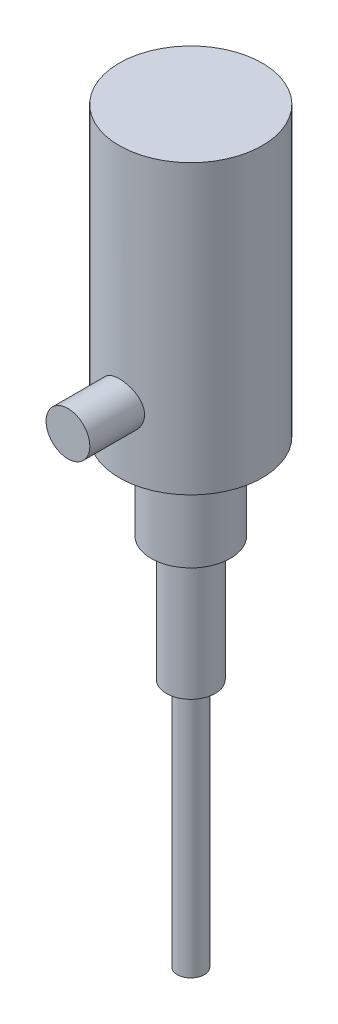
ISO-10303-21;
HEADER;
FILE_DESCRIPTION(('STEP AP214'),'2;1');
FILE_NAME('part.step','',(''),(''),'','','');
FILE_SCHEMA(('AUTOMOTIVE_DESIGN { 1 0 10303 214 1 1 1 1 }'));
ENDSEC;
DATA;
#1=APPLICATION_CONTEXT('core data for automotive mechanical design processes');
#2=APPLICATION_PROTOCOL_DEFINITION('international standard','automotive_design',2000,#1);
#3=PRODUCT_CONTEXT('',#1,'mechanical');
#4=PRODUCT('Part','Part','',(#3));
#5=PRODUCT_RELATED_PRODUCT_CATEGORY('part','',(#4));
#6=PRODUCT_DEFINITION_FORMATION('','',#4);
#7=PRODUCT_DEFINITION_CONTEXT('part definition',#1,'design');
#8=PRODUCT_DEFINITION('design','',#6,#7);
#9=PRODUCT_DEFINITION_SHAPE('','',#8);
#10=(LENGTH_UNIT() NAMED_UNIT(*) SI_UNIT(.MILLI.,.METRE.));
#11=(NAMED_UNIT(*) PLANE_ANGLE_UNIT() SI_UNIT($,.RADIAN.));
#12=(NAMED_UNIT(*) SI_UNIT($,.STERADIAN.) SOLID_ANGLE_UNIT());
#13=UNCERTAINTY_MEASURE_WITH_UNIT(LENGTH_MEASURE(1.E-05),#10,'distance_accuracy_value','');
#14=(GEOMETRIC_REPRESENTATION_CONTEXT(3) GLOBAL_UNCERTAINTY_ASSIGNED_CONTEXT((#13)) GLOBAL_UNIT_ASSIGNED_CONTEXT((#10,
#11,#12)) REPRESENTATION_CONTEXT('',''));
#15=CARTESIAN_POINT('',(0.,0.,0.));
#16=DIRECTION('',(0.,0.,1.));
#17=DIRECTION('',(1.,0.,0.));
#18=AXIS2_PLACEMENT_3D('',#15,#16,#17);
#19=CARTESIAN_POINT('',(0.,0.,0.));
#20=DIRECTION('',(0.,-1.,0.));
#21=DIRECTION('',(1.,0.,0.));
#22=AXIS2_PLACEMENT_3D('',#19,#20,#21);
#23=PLANE('',#22);
#24=CARTESIAN_POINT('',(0.,0.,0.));
#25=DIRECTION('',(0.,1.,0.));
#26=DIRECTION('',(-1.,0.,0.));
#27=AXIS2_PLACEMENT_3D('',#24,#25,#26);
#28=CIRCLE('',#27,8.);
#29=CARTESIAN_POINT('',(-8.,0.,0.));
#30=VERTEX_POINT('',#29);
#31=EDGE_CURVE('E43',#30,#30,#28,.T.);
#32=ORIENTED_EDGE('',*,*,#31,.F.);
#33=EDGE_LOOP('',(#32));
#34=FACE_BOUND('',#33,.T.);
#35=ADVANCED_FACE('F33',(#34),#23,.T.);
#36=CARTESIAN_POINT('',(0.,444.,0.));
#37=DIRECTION('',(0.,1.,0.));
#38=DIRECTION('',(-1.,0.,0.));
#39=AXIS2_PLACEMENT_3D('',#36,#37,#38);
#40=CYLINDRICAL_SURFACE('',#39,8.);
#41=ORIENTED_EDGE('',*,*,#31,.T.);
#42=EDGE_LOOP('',(#41));
#43=FACE_BOUND('',#42,.T.);
#44=CARTESIAN_POINT('',(0.,148.,0.));
#45=DIRECTION('',(0.,1.,0.));
#46=DIRECTION('',(-1.,0.,0.));
#47=AXIS2_PLACEMENT_3D('',#44,#45,#46);
#48=CIRCLE('',#47,8.);
#49=CARTESIAN_POINT('',(-8.,148.,0.));
#50=VERTEX_POINT('',#49);
#51=EDGE_CURVE('E47',#50,#50,#48,.T.);
#52=ORIENTED_EDGE('',*,*,#51,.F.);
#53=EDGE_LOOP('',(#52));
#54=FACE_BOUND('',#53,.T.);
#55=ADVANCED_FACE('F87',(#43,#54),#40,.T.);
#56=CARTESIAN_POINT('',(-8.,148.,0.));
#57=DIRECTION('',(0.,-1.,0.));
#58=DIRECTION('',(1.,0.,0.));
#59=AXIS2_PLACEMENT_3D('',#56,#57,#58);
#60=PLANE('',#59);
#61=ORIENTED_EDGE('',*,*,#51,.T.);
#62=EDGE_LOOP('',(#61));
#63=FACE_BOUND('',#62,.T.);
#64=CARTESIAN_POINT('',(0.,148.,0.));
#65=DIRECTION('',(0.,1.,0.));
#66=DIRECTION('',(-1.,0.,0.));
#67=AXIS2_PLACEMENT_3D('',#64,#65,#66);
#68=CIRCLE('',#67,14.5);
#69=CARTESIAN_POINT('',(-14.5,148.,0.));
#70=VERTEX_POINT('',#69);
#71=EDGE_CURVE('E51',#70,#70,#68,.T.);
#72=ORIENTED_EDGE('',*,*,#71,.F.);
#73=EDGE_LOOP('',(#72));
#74=FACE_BOUND('',#73,.T.);
#75=ADVANCED_FACE('F92',(#63,#74),#60,.T.);
#76=CARTESIAN_POINT('',(0.,444.,0.));
#77=DIRECTION('',(0.,1.,0.));
#78=DIRECTION('',(-1.,0.,0.));
#79=AXIS2_PLACEMENT_3D('',#76,#77,#78);
#80=CYLINDRICAL_SURFACE('',#79,14.5);
#81=ORIENTED_EDGE('',*,*,#71,.T.);
#82=EDGE_LOOP('',(#81));
#83=FACE_BOUND('',#82,.T.);
#84=CARTESIAN_POINT('',(0.,222.,0.));
#85=DIRECTION('',(0.,1.,0.));
#86=DIRECTION('',(-1.,0.,0.));
#87=AXIS2_PLACEMENT_3D('',#84,#85,#86);
#88=CIRCLE('',#87,14.5);
#89=CARTESIAN_POINT('',(-14.5,222.,0.));
#90=VERTEX_POINT('',#89);
#91=EDGE_CURVE('E56',#90,#90,#88,.T.);
#92=ORIENTED_EDGE('',*,*,#91,.F.);
#93=EDGE_LOOP('',(#92));
#94=FACE_BOUND('',#93,.T.);
#95=ADVANCED_FACE('F96',(#83,#94),#80,.T.);
#96=CARTESIAN_POINT('',(-14.5,222.,0.));
#97=DIRECTION('',(0.,-1.,0.));
#98=DIRECTION('',(1.,0.,0.));
#99=AXIS2_PLACEMENT_3D('',#96,#97,#98);
#100=PLANE('',#99);
#101=ORIENTED_EDGE('',*,*,#91,.T.);
#102=EDGE_LOOP('',(#101));
#103=FACE_BOUND('',#102,.T.);
#104=CARTESIAN_POINT('',(0.,222.,0.));
#105=DIRECTION('',(0.,1.,0.));
#106=DIRECTION('',(-1.,0.,0.));
#107=AXIS2_PLACEMENT_3D('',#104,#105,#106);
#108=CIRCLE('',#107,23.5);
#109=CARTESIAN_POINT('',(-23.5,222.,0.));
#110=VERTEX_POINT('',#109);
#111=EDGE_CURVE('E59',#110,#110,#108,.T.);
#112=ORIENTED_EDGE('',*,*,#111,.F.);
#113=EDGE_LOOP('',(#112));
#114=FACE_BOUND('',#113,.T.);
#115=ADVANCED_FACE('F103',(#103,#114),#100,.T.);
#116=CARTESIAN_POINT('',(0.,444.,0.));
#117=DIRECTION('',(0.,1.,0.));
#118=DIRECTION('',(-1.,0.,0.));
#119=AXIS2_PLACEMENT_3D('',#116,#117,#118);
#120=CYLINDRICAL_SURFACE('',#119,23.5);
#121=ORIENTED_EDGE('',*,*,#111,.T.);
#122=EDGE_LOOP('',(#121));
#123=FACE_BOUND('',#122,.T.);
#124=CARTESIAN_POINT('',(0.,273.,0.));
#125=DIRECTION('',(0.,1.,0.));
#126=DIRECTION('',(-1.,0.,0.));
#127=AXIS2_PLACEMENT_3D('',#124,#125,#126);
#128=CIRCLE('',#127,23.5);
#129=CARTESIAN_POINT('',(-23.5,273.,0.));
#130=VERTEX_POINT('',#129);
#131=EDGE_CURVE('E62',#130,#130,#128,.T.);
#132=ORIENTED_EDGE('',*,*,#131,.F.);
#133=EDGE_LOOP('',(#132));
#134=FACE_BOUND('',#133,.T.);
#135=ADVANCED_FACE('F107',(#123,#134),#120,.T.);
#136=CARTESIAN_POINT('',(-23.5,273.,0.));
#137=DIRECTION('',(0.,-1.,0.));
#138=DIRECTION('',(1.,0.,0.));
#139=AXIS2_PLACEMENT_3D('',#136,#137,#138);
#140=PLANE('',#139);
#141=ORIENTED_EDGE('',*,*,#131,.T.);
#142=EDGE_LOOP('',(#141));
#143=FACE_BOUND('',#142,.T.);
#144=CARTESIAN_POINT('',(0.,273.,0.));
#145=DIRECTION('',(0.,1.,0.));
#146=DIRECTION('',(-1.,0.,0.));
#147=AXIS2_PLACEMENT_3D('',#144,#145,#146);
#148=CIRCLE('',#147,42.5);
#149=CARTESIAN_POINT('',(-42.5,273.,0.));
#150=VERTEX_POINT('',#149);
#151=EDGE_CURVE('E65',#150,#150,#148,.T.);
#152=ORIENTED_EDGE('',*,*,#151,.F.);
#153=EDGE_LOOP('',(#152));
#154=FACE_BOUND('',#153,.T.);
#155=ADVANCED_FACE('F111',(#143,#154),#140,.T.);
#156=CARTESIAN_POINT('',(0.,444.,0.));
#157=DIRECTION('',(0.,1.,0.));
#158=DIRECTION('',(-1.,0.,0.));
#159=AXIS2_PLACEMENT_3D('',#156,#157,#158);
#160=CYLINDRICAL_SURFACE('',#159,42.5);
#161=CARTESIAN_POINT('',(13.,311.,40.4629460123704));
#162=CARTESIAN_POINT('',(12.9999994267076,311.355829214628,40.4629464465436));
#163=CARTESIAN_POINT('',(12.9853783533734,311.711668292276,40.4676524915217));
#164=CARTESIAN_POINT('',(12.927030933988,312.42071181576,40.4863285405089));
#165=CARTESIAN_POINT('',(12.8833034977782,312.773916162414,40.5002988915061));
#166=CARTESIAN_POINT('',(12.7671362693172,313.475194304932,40.5370686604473));
#167=CARTESIAN_POINT('',(12.6946890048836,313.823266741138,40.5598703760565));
#168=CARTESIAN_POINT('',(12.5217338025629,314.51171714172,40.6135983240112));
#169=CARTESIAN_POINT('',(12.4212259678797,314.852095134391,40.6445245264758));
#170=CARTESIAN_POINT('',(12.1932055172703,315.522256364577,40.713509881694));
#171=CARTESIAN_POINT('',(12.0657404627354,315.852057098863,40.7515564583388));
#172=CARTESIAN_POINT('',(11.7847140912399,316.499552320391,40.8337107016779));
#173=CARTESIAN_POINT('',(11.6311527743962,316.817246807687,40.8778183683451));
#174=CARTESIAN_POINT('',(11.2990783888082,317.438547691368,40.9708499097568));
#175=CARTESIAN_POINT('',(11.1205666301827,317.742154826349,41.0197735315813));
#176=CARTESIAN_POINT('',(10.73974886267,318.333590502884,41.1211213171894));
#177=CARTESIAN_POINT('',(10.5374343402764,318.621413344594,41.1735467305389));
#178=CARTESIAN_POINT('',(10.1040272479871,319.187766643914,41.2820783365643));
#179=CARTESIAN_POINT('',(9.8722590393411,319.465768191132,41.3382475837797));
#180=CARTESIAN_POINT('',(9.38643719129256,320.00141874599,41.4512603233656));
#181=CARTESIAN_POINT('',(9.13238318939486,320.259067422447,41.5081038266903));
#182=CARTESIAN_POINT('',(8.60350283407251,320.752464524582,41.6209425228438));
#183=CARTESIAN_POINT('',(8.32867011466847,320.988206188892,41.6769374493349));
#184=CARTESIAN_POINT('',(7.76010468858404,321.436076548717,41.7865355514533));
#185=CARTESIAN_POINT('',(7.46637861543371,321.648213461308,41.8401395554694));
#186=CARTESIAN_POINT('',(6.8551650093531,322.051866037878,41.9446647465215));
#187=CARTESIAN_POINT('',(6.53729887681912,322.242830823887,41.9955018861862));
#188=CARTESIAN_POINT('',(5.88576422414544,322.59721083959,42.0917593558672));
#189=CARTESIAN_POINT('',(5.55209540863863,322.760625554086,42.1371795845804));
#190=CARTESIAN_POINT('',(4.87132923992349,323.058530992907,42.2212949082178));
#191=CARTESIAN_POINT('',(4.52423423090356,323.193026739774,42.259991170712));
#192=CARTESIAN_POINT('',(3.81907988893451,323.431942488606,42.3295419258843));
#193=CARTESIAN_POINT('',(3.46102094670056,323.536363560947,42.3603966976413));
#194=CARTESIAN_POINT('',(2.74738974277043,323.711522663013,42.4125692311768));
#195=CARTESIAN_POINT('',(2.39205873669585,323.783167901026,42.4341427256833));
#196=CARTESIAN_POINT('',(1.67623519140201,323.896570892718,42.4684425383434));
#197=CARTESIAN_POINT('',(1.31574274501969,323.938329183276,42.4811690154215));
#198=CARTESIAN_POINT('',(0.592389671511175,323.991557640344,42.4974108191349));
#199=CARTESIAN_POINT('',(0.229529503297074,324.003033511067,42.5009278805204));
#200=CARTESIAN_POINT('',(-0.495846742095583,323.99560251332,42.4986549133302));
#201=CARTESIAN_POINT('',(-0.858362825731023,323.976696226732,42.4928650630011));
#202=CARTESIAN_POINT('',(-1.56830680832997,323.909814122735,42.4724891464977));
#203=CARTESIAN_POINT('',(-1.91583653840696,323.862822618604,42.4582010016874));
#204=CARTESIAN_POINT('',(-2.60553823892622,323.741028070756,42.4214618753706));
#205=CARTESIAN_POINT('',(-2.94771034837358,323.666225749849,42.3990111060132));
#206=CARTESIAN_POINT('',(-3.62437225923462,323.489444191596,42.3465358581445));
#207=CARTESIAN_POINT('',(-3.9588617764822,323.387463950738,42.3165110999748));
#208=CARTESIAN_POINT('',(-4.61794277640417,323.157157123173,42.2496666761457));
#209=CARTESIAN_POINT('',(-4.94253406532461,323.028830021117,42.2128468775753));
#210=CARTESIAN_POINT('',(-5.58355006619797,322.745138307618,42.1328795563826));
#211=CARTESIAN_POINT('',(-5.89983160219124,322.589470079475,42.089661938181));
#212=CARTESIAN_POINT('',(-6.51817553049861,322.25332088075,41.9983461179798));
#213=CARTESIAN_POINT('',(-6.82023786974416,322.072839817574,41.950247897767));
#214=CARTESIAN_POINT('',(-7.40834014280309,321.688308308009,41.8503939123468));
#215=CARTESIAN_POINT('',(-7.69437947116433,321.484256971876,41.7986380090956));
#216=CARTESIAN_POINT('',(-8.24884139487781,321.053846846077,41.692760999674));
#217=CARTESIAN_POINT('',(-8.51725768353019,320.827480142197,41.6386390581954));
#218=CARTESIAN_POINT('',(-9.04513035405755,320.34444520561,41.5272351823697));
#219=CARTESIAN_POINT('',(-9.30380261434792,320.086928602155,41.4699133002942));
#220=CARTESIAN_POINT('',(-9.7986413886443,319.551003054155,41.3557870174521));
#221=CARTESIAN_POINT('',(-10.0348076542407,319.272593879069,41.2989826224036));
#222=CARTESIAN_POINT('',(-10.4831492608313,318.696546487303,41.1874613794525));
#223=CARTESIAN_POINT('',(-10.6953172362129,318.398902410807,41.1327451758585));
#224=CARTESIAN_POINT('',(-11.0940303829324,317.786453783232,41.027003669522));
#225=CARTESIAN_POINT('',(-11.2805850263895,317.471655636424,40.9759770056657));
#226=CARTESIAN_POINT('',(-11.6286110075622,316.823414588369,40.8785814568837));
#227=CARTESIAN_POINT('',(-11.7897967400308,316.489809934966,40.832267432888));
#228=CARTESIAN_POINT('',(-12.0833700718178,315.8093116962,40.746356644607));
#229=CARTESIAN_POINT('',(-12.2157573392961,315.462417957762,40.7067599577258));
#230=CARTESIAN_POINT('',(-12.4505348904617,314.757924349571,40.6355662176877));
#231=CARTESIAN_POINT('',(-12.5529335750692,314.400327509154,40.6039669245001));
#232=CARTESIAN_POINT('',(-12.7268166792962,313.67702611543,40.5498021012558));
#233=CARTESIAN_POINT('',(-12.7983023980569,313.31132190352,40.5272361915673));
#234=CARTESIAN_POINT('',(-12.9075028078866,312.588906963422,40.4925859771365));
#235=CARTESIAN_POINT('',(-12.9464157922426,312.232394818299,40.4801303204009));
#236=CARTESIAN_POINT('',(-12.9946523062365,311.517172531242,40.4646717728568));
#237=CARTESIAN_POINT('',(-13.0039765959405,311.158462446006,40.4616686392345));
#238=CARTESIAN_POINT('',(-12.9929472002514,310.441596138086,40.465211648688));
#239=CARTESIAN_POINT('',(-12.9725974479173,310.083439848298,40.4717565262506));
#240=CARTESIAN_POINT('',(-12.902423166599,309.370326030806,40.4941826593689));
#241=CARTESIAN_POINT('',(-12.8525989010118,309.015368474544,40.5100638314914));
#242=CARTESIAN_POINT('',(-12.7257106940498,308.320923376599,40.5500995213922));
#243=CARTESIAN_POINT('',(-12.6494303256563,307.981278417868,40.5740154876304));
#244=CARTESIAN_POINT('',(-12.4700880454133,307.309787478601,40.6294930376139));
#245=CARTESIAN_POINT('',(-12.3670267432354,306.977941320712,40.6610544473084));
#246=CARTESIAN_POINT('',(-12.134960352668,306.324206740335,40.7309146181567));
#247=CARTESIAN_POINT('',(-12.0059565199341,306.002317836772,40.7692130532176));
#248=CARTESIAN_POINT('',(-11.722929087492,305.370359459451,40.8514950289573));
#249=CARTESIAN_POINT('',(-11.5688965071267,305.060294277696,40.8954806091));
#250=CARTESIAN_POINT('',(-11.2323588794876,304.445593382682,40.9892113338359));
#251=CARTESIAN_POINT('',(-11.0491870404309,304.141341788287,41.039081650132));
#252=CARTESIAN_POINT('',(-10.6588751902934,303.549219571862,41.1421816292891));
#253=CARTESIAN_POINT('',(-10.4517343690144,303.261349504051,41.1954114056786));
#254=CARTESIAN_POINT('',(-10.0147552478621,302.703601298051,41.3038176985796));
#255=CARTESIAN_POINT('',(-9.78490849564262,302.433729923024,41.3589949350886));
#256=CARTESIAN_POINT('',(-9.30408719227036,301.913784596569,41.4698058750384));
#257=CARTESIAN_POINT('',(-9.05311930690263,301.663704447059,41.5254394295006));
#258=CARTESIAN_POINT('',(-8.52113601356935,301.175247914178,41.6379278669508));
#259=CARTESIAN_POINT('',(-8.23932344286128,300.93772977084,41.6947436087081));
#260=CARTESIAN_POINT('',(-7.65621681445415,300.487241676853,41.8057462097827));
#261=CARTESIAN_POINT('',(-7.35492220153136,300.274272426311,41.8599329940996));
#262=CARTESIAN_POINT('',(-6.73481113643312,299.874425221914,41.9641650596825));
#263=CARTESIAN_POINT('',(-6.41599503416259,299.68754674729,42.0142104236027));
#264=CARTESIAN_POINT('',(-5.76296053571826,299.341318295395,42.1087533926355));
#265=CARTESIAN_POINT('',(-5.4287424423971,299.181967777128,42.1532511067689));
#266=CARTESIAN_POINT('',(-4.74976968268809,298.893193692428,42.2351242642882));
#267=CARTESIAN_POINT('',(-4.40511298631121,298.76355437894,42.2725506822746));
#268=CARTESIAN_POINT('',(-3.70534711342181,298.533805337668,42.33962596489));
#269=CARTESIAN_POINT('',(-3.35023794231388,298.433695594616,42.3692748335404));
#270=CARTESIAN_POINT('',(-2.6322926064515,298.263946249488,42.4199304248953));
#271=CARTESIAN_POINT('',(-2.26945837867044,298.194299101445,42.4409392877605));
#272=CARTESIAN_POINT('',(-1.53877201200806,298.086109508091,42.4737083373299));
#273=CARTESIAN_POINT('',(-1.17092004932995,298.047565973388,42.4854688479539));
#274=CARTESIAN_POINT('',(-0.447859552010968,298.002871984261,42.4991166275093));
#275=CARTESIAN_POINT('',(-0.092733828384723,297.995487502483,42.5013800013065));
#276=CARTESIAN_POINT('',(0.616869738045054,298.00979608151,42.4970039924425));
#277=CARTESIAN_POINT('',(0.971347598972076,298.031488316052,42.4903648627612));
#278=CARTESIAN_POINT('',(1.67704719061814,298.103747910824,42.4683663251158));
#279=CARTESIAN_POINT('',(2.0282691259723,298.154313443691,42.4530074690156));
#280=CARTESIAN_POINT('',(2.72496003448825,298.283863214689,42.4139873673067));
#281=CARTESIAN_POINT('',(3.07042898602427,298.362847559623,42.3903260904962));
#282=CARTESIAN_POINT('',(3.74923672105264,298.547469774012,42.3356567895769));
#283=CARTESIAN_POINT('',(4.0826697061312,298.652787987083,42.3047371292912));
#284=CARTESIAN_POINT('',(4.73936119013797,298.889661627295,42.2362101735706));
#285=CARTESIAN_POINT('',(5.06261981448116,299.021216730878,42.1986029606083));
#286=CARTESIAN_POINT('',(5.69690995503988,299.309551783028,42.117661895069));
#287=CARTESIAN_POINT('',(6.00794212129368,299.466330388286,42.0743283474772));
#288=CARTESIAN_POINT('',(6.61602844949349,299.804055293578,41.9830054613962));
#289=CARTESIAN_POINT('',(6.91307719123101,299.985010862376,41.9350143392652));
#290=CARTESIAN_POINT('',(7.50073699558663,300.376086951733,41.8339659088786));
#291=CARTESIAN_POINT('',(7.79082500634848,300.586964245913,41.7807946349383));
#292=CARTESIAN_POINT('',(8.35246572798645,301.03181488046,41.6721511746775));
#293=CARTESIAN_POINT('',(8.62400992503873,301.265798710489,41.6166779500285));
#294=CARTESIAN_POINT('',(9.14684614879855,301.755353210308,41.5048997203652));
#295=CARTESIAN_POINT('',(9.39813257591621,302.010929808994,41.4485944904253));
#296=CARTESIAN_POINT('',(9.87871537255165,302.541917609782,41.3366888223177));
#297=CARTESIAN_POINT('',(10.1080212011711,302.817320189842,41.2810880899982));
#298=CARTESIAN_POINT('',(10.5502395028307,303.395457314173,41.1703298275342));
#299=CARTESIAN_POINT('',(10.7623979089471,303.698782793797,41.1152427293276));
#300=CARTESIAN_POINT('',(11.1602845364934,304.32280547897,41.0090289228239));
#301=CARTESIAN_POINT('',(11.3460222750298,304.64349637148,40.9579007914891));
#302=CARTESIAN_POINT('',(11.6897056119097,305.300167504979,40.8611388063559));
#303=CARTESIAN_POINT('',(11.847656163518,305.636145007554,40.8155039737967));
#304=CARTESIAN_POINT('',(12.1344894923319,306.321111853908,40.7311494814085));
#305=CARTESIAN_POINT('',(12.2633749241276,306.670100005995,40.6924291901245));
#306=CARTESIAN_POINT('',(12.4798565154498,307.344049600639,40.6265269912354));
#307=CARTESIAN_POINT('',(12.5702513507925,307.668041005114,40.5985886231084));
#308=CARTESIAN_POINT('',(12.7257415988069,308.322571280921,40.5501189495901));
#309=CARTESIAN_POINT('',(12.7908389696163,308.653109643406,40.5295870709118));
#310=CARTESIAN_POINT('',(12.8952014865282,309.318574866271,40.49650333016));
#311=CARTESIAN_POINT('',(12.9344714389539,309.653500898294,40.4839499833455));
#312=CARTESIAN_POINT('',(12.9868716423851,310.325614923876,40.4671709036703));
#313=CARTESIAN_POINT('',(13.0000005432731,310.662803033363,40.4629456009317));
#314=CARTESIAN_POINT('',(13.,311.,40.4629460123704));
#315=B_SPLINE_CURVE_WITH_KNOTS('',3,(#161,#162,#163,#164,#165,#166,#167,#168,#169,#170,#171,
#172,#173,#174,#175,#176,#177,#178,#179,#180,#181,#182,#183,#184,#185,#186,#187,#188,#189,#190,
#191,#192,#193,#194,#195,#196,#197,#198,#199,#200,#201,#202,#203,#204,#205,#206,#207,#208,#209,
#210,#211,#212,#213,#214,#215,#216,#217,#218,#219,#220,#221,#222,#223,#224,#225,#226,#227,#228,
#229,#230,#231,#232,#233,#234,#235,#236,#237,#238,#239,#240,#241,#242,#243,#244,#245,#246,#247,
#248,#249,#250,#251,#252,#253,#254,#255,#256,#257,#258,#259,#260,#261,#262,#263,#264,#265,#266,
#267,#268,#269,#270,#271,#272,#273,#274,#275,#276,#277,#278,#279,#280,#281,#282,#283,#284,#285,
#286,#287,#288,#289,#290,#291,#292,#293,#294,#295,#296,#297,#298,#299,#300,#301,#302,#303,#304,
#305,#306,#307,#308,#309,#310,#311,#312,#313,#314),.UNSPECIFIED.,.T.,.F.,(4,2,2,2,2,2,2,2,2,2,2,
2,2,2,2,2,2,2,2,2,2,2,2,2,2,2,2,2,2,2,2,2,2,2,2,2,2,2,2,2,2,2,2,2,2,2,2,2,2,2,2,2,2,2,2,2,2,2,2,
2,2,2,2,2,2,2,2,2,2,2,2,2,2,2,2,2,4),(0.,1.06717491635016,2.13438980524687,3.20188253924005,
4.26937134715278,5.33499223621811,6.4006131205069,7.46617807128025,8.53212530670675,
9.62969241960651,10.7272773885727,11.8251999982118,12.9227392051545,14.0442238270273,
15.1657294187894,16.2870400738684,17.4083108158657,18.496323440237,19.5843165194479,
20.6721046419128,21.7598719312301,22.8115839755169,23.8632686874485,24.9149922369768,
25.9667363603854,27.0309981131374,28.0952638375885,29.1595697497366,30.2242544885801,
31.3313956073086,32.4385489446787,33.5460411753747,34.6531227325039,35.7718921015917,
36.8906743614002,38.009142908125,39.1275644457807,40.2027657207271,41.2779393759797,
42.3529705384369,43.4279920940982,44.4735652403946,45.519114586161,46.5646133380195,
47.6104880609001,48.6851393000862,49.7598268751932,50.8349160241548,51.9096671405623,
53.0270672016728,54.1444991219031,55.2619087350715,56.3792963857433,57.4882931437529,
58.5972893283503,59.7060106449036,60.8146931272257,61.8790293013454,62.9433352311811,
64.0075738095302,65.0718163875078,66.1237194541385,67.1756095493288,68.2274436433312,
69.2796821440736,70.3661212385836,71.4530558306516,72.5402898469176,73.6270538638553,
74.7484076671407,75.8693565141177,76.9901053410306,78.1107517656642,79.122260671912,
80.1336912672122,81.1449335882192,82.1562281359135),.UNSPECIFIED.);
#316=CARTESIAN_POINT('',(13.,311.,40.4629460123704));
#317=VERTEX_POINT('',#316);
#318=EDGE_CURVE('E10',#317,#317,#315,.T.);
#319=ORIENTED_EDGE('',*,*,#318,.F.);
#320=EDGE_LOOP('',(#319));
#321=FACE_BOUND('',#320,.T.);
#322=ORIENTED_EDGE('',*,*,#151,.T.);
#323=EDGE_LOOP('',(#322));
#324=FACE_BOUND('',#323,.T.);
#325=CARTESIAN_POINT('',(0.,444.,0.));
#326=DIRECTION('',(0.,1.,0.));
#327=DIRECTION('',(-1.,0.,0.));
#328=AXIS2_PLACEMENT_3D('',#325,#326,#327);
#329=CIRCLE('',#328,42.5);
#330=CARTESIAN_POINT('',(-42.5,444.,0.));
#331=VERTEX_POINT('',#330);
#332=EDGE_CURVE('E68',#331,#331,#329,.T.);
#333=ORIENTED_EDGE('',*,*,#332,.F.);
#334=EDGE_LOOP('',(#333));
#335=FACE_BOUND('',#334,.T.);
#336=ADVANCED_FACE('F114',(#321,#324,#335),#160,.T.);
#337=CARTESIAN_POINT('',(-42.5,444.,0.));
#338=DIRECTION('',(0.,1.,0.));
#339=DIRECTION('',(-1.,0.,0.));
#340=AXIS2_PLACEMENT_3D('',#337,#338,#339);
#341=PLANE('',#340);
#342=ORIENTED_EDGE('',*,*,#332,.T.);
#343=EDGE_LOOP('',(#342));
#344=FACE_BOUND('',#343,.T.);
#345=ADVANCED_FACE('F82',(#344),#341,.T.);
#346=CARTESIAN_POINT('',(0.,311.,73.));
#347=DIRECTION('',(0.,0.,1.));
#348=DIRECTION('',(1.,0.,0.));
#349=AXIS2_PLACEMENT_3D('',#346,#347,#348);
#350=PLANE('',#349);
#351=CARTESIAN_POINT('',(0.,311.,73.));
#352=DIRECTION('',(0.,0.,1.));
#353=DIRECTION('',(1.,0.,0.));
#354=AXIS2_PLACEMENT_3D('',#351,#352,#353);
#355=CIRCLE('',#354,13.);
#356=CARTESIAN_POINT('',(13.,311.,73.));
#357=VERTEX_POINT('',#356);
#358=EDGE_CURVE('E71',#357,#357,#355,.T.);
#359=ORIENTED_EDGE('',*,*,#358,.T.);
#360=EDGE_LOOP('',(#359));
#361=FACE_BOUND('',#360,.T.);
#362=ADVANCED_FACE('F75',(#361),#350,.T.);
#363=CARTESIAN_POINT('',(0.,311.,-42.501));
#364=DIRECTION('',(0.,0.,1.));
#365=DIRECTION('',(1.,0.,0.));
#366=AXIS2_PLACEMENT_3D('',#363,#364,#365);
#367=CYLINDRICAL_SURFACE('',#366,13.);
#368=ORIENTED_EDGE('',*,*,#318,.T.);
#369=EDGE_LOOP('',(#368));
#370=FACE_BOUND('',#369,.T.);
#371=ORIENTED_EDGE('',*,*,#358,.F.);
#372=EDGE_LOOP('',(#371));
#373=FACE_BOUND('',#372,.T.);
#374=ADVANCED_FACE('F77',(#370,#373),#367,.T.);
#375=CLOSED_SHELL('',(#35,#55,#75,#95,#115,#135,#155,#336,#345,#362,#374));
#376=MANIFOLD_SOLID_BREP('B2',#375);
#377=ADVANCED_BREP_SHAPE_REPRESENTATION('',(#18,#376),#14);
#378=SHAPE_DEFINITION_REPRESENTATION(#9,#377);
ENDSEC;
END-ISO-10303-21;
